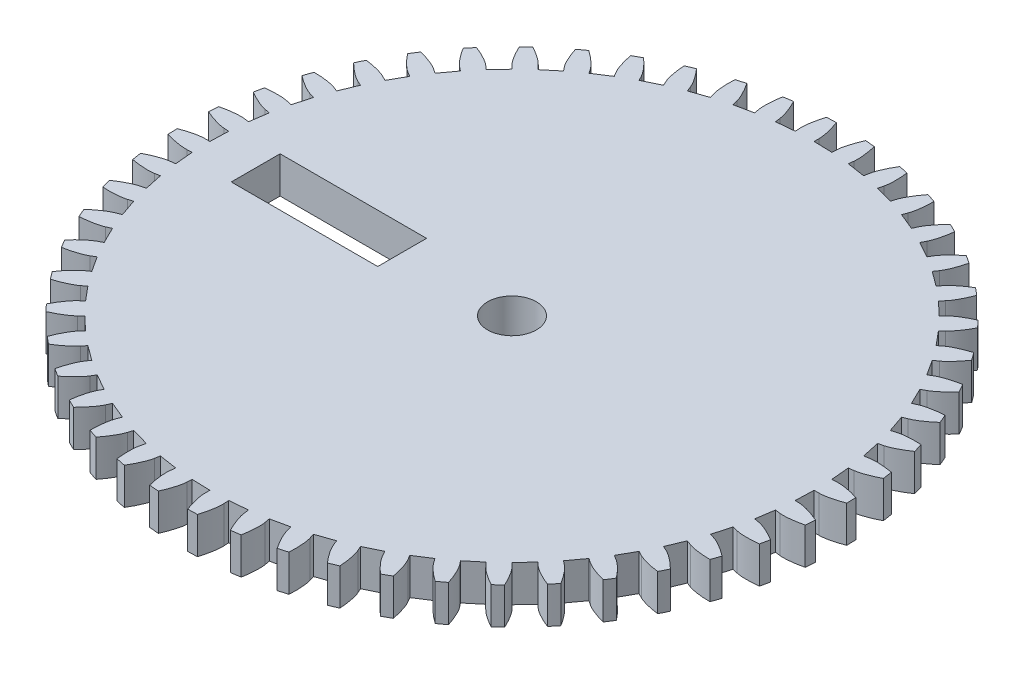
from build123d import *

# Parameters (mm, degrees)
BOSS_EXTRUDE1_DEPTH = 1.5
CIRPATTERN1_COUNT   = 52
SKETCH3_W           = 6
SKETCH3_H           = 2
CUT_EXTRUDE1_DEPTH  = 1.5


with BuildPart() as part:
    # Sketch2 → Boss-Extrude1 (new body)
    with BuildSketch(Plane(origin=(0, 0, 0), x_dir=(1, 0, 0), z_dir=(0, 1, 0))):
        with BuildLine():
            Line((-12.562956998, -0.759918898), (-12.352422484, -0.747183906))
            Line((-12.352422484, -0.747183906), (-12.284772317, -1.491641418))
            Line((-12.284772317, -1.491641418), (-0.992708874, -0.12053668))
            ThreePointArc((-0.992708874, -0.12053668), (-0.998175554, -0.060378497), (-1, 0))
            Line((-1, 0), (-12.585919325, 0))
            add(Edge.make_bspline(
                [(-12.585919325, 0), (-12.608007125, 0), (-12.669896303, -0.002279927), (-12.786461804, -0.015538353), (-12.974844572, -0.049818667), (-13.181302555, -0.10396479), (-13.346227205, -0.157562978), (-13.457243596, -0.19793865), (-13.498312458, -0.213449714)],
                knots=[0, 0, 0, 0, 0, 0.005376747, 0.015083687, 0.028531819, 0.046610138, 0.057302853, 0.057302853, 0.057302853, 0.057302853, 0.057302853], degree=4))
            ThreePointArc((-13.498312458, -0.213449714), (-13.493841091, -0.407740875), (-13.486573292, -0.601947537))
            add(Edge.make_bspline(
                [(-12.562956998, -0.759918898), (-12.5850045, -0.761252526), (-12.646918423, -0.762713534), (-12.76407178, -0.756517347), (-12.954180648, -0.733673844), (-13.163531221, -0.692092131), (-13.331391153, -0.648549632), (-13.444642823, -0.614950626), (-13.486573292, -0.601947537)],
                knots=[0, 0, 0, 0, 0, 0.005376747, 0.015083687, 0.028531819, 0.046610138, 0.057302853, 0.057302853, 0.057302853, 0.057302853, 0.057302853], degree=4))
        make_face()
    boss_extrude1 = extrude(amount=BOSS_EXTRUDE1_DEPTH)

    # CirPattern1: Boss-Extrude1 ×52 about axis
    cirpattern1_axis = Axis((0, 0, 0), (0, -1, 0))
    for i in range(1, CIRPATTERN1_COUNT):
        add(boss_extrude1.rotate(cirpattern1_axis, i * 360 / CIRPATTERN1_COUNT))

    # Sketch3 → Cut-Extrude1 (cut)
    with BuildSketch(Plane(origin=(0, 1.5, 0), x_dir=(1, 0, 0), z_dir=(0, 1, 0))):
        with Locations((-7.5, 0)):
            Rectangle(SKETCH3_W, SKETCH3_H)
    extrude(amount=-CUT_EXTRUDE1_DEPTH, mode=Mode.SUBTRACT)


solid = part.part
